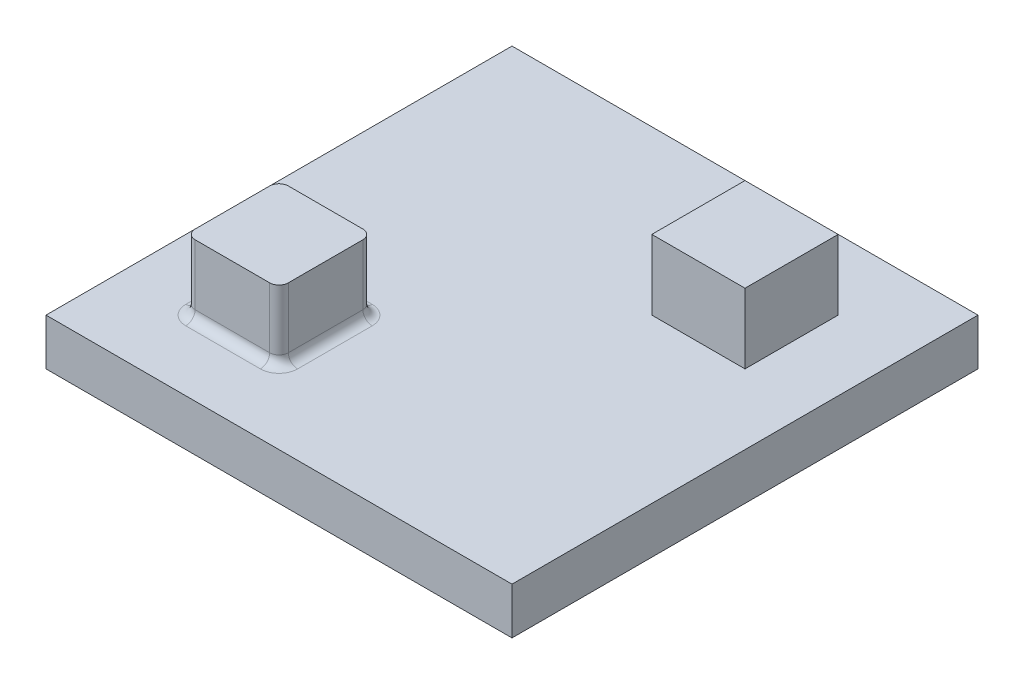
ISO-10303-21;
HEADER;
FILE_DESCRIPTION(('STEP AP214'),'2;1');
FILE_NAME('part.step','',(''),(''),'','','');
FILE_SCHEMA(('AUTOMOTIVE_DESIGN { 1 0 10303 214 1 1 1 1 }'));
ENDSEC;
DATA;
#1=APPLICATION_CONTEXT('core data for automotive mechanical design processes');
#2=APPLICATION_PROTOCOL_DEFINITION('international standard','automotive_design',2000,#1);
#3=PRODUCT_CONTEXT('',#1,'mechanical');
#4=PRODUCT('Part','Part','',(#3));
#5=PRODUCT_RELATED_PRODUCT_CATEGORY('part','',(#4));
#6=PRODUCT_DEFINITION_FORMATION('','',#4);
#7=PRODUCT_DEFINITION_CONTEXT('part definition',#1,'design');
#8=PRODUCT_DEFINITION('design','',#6,#7);
#9=PRODUCT_DEFINITION_SHAPE('','',#8);
#10=(LENGTH_UNIT() NAMED_UNIT(*) SI_UNIT(.MILLI.,.METRE.));
#11=(NAMED_UNIT(*) PLANE_ANGLE_UNIT() SI_UNIT($,.RADIAN.));
#12=(NAMED_UNIT(*) SI_UNIT($,.STERADIAN.) SOLID_ANGLE_UNIT());
#13=UNCERTAINTY_MEASURE_WITH_UNIT(LENGTH_MEASURE(1.E-05),#10,'distance_accuracy_value','');
#14=(GEOMETRIC_REPRESENTATION_CONTEXT(3) GLOBAL_UNCERTAINTY_ASSIGNED_CONTEXT((#13)) GLOBAL_UNIT_ASSIGNED_CONTEXT((#10,
#11,#12)) REPRESENTATION_CONTEXT('',''));
#15=CARTESIAN_POINT('',(0.,0.,0.));
#16=DIRECTION('',(0.,0.,1.));
#17=DIRECTION('',(1.,0.,0.));
#18=AXIS2_PLACEMENT_3D('',#15,#16,#17);
#19=CARTESIAN_POINT('',(-63.5,12.7,63.5));
#20=DIRECTION('',(0.,1.,0.));
#21=DIRECTION('',(0.,0.,1.));
#22=AXIS2_PLACEMENT_3D('',#19,#20,#21);
#23=PLANE('',#22);
#24=DIRECTION('',(0.,0.,1.));
#25=VECTOR('',#24,1.);
#26=CARTESIAN_POINT('',(-63.5,12.7,-63.5));
#27=LINE('',#26,#25);
#28=CARTESIAN_POINT('',(-63.5,12.7,-63.5));
#29=VERTEX_POINT('',#28);
#30=CARTESIAN_POINT('',(-63.5,12.7,63.5));
#31=VERTEX_POINT('',#30);
#32=EDGE_CURVE('E264',#29,#31,#27,.T.);
#33=ORIENTED_EDGE('',*,*,#32,.T.);
#34=DIRECTION('',(1.,0.,0.));
#35=VECTOR('',#34,1.);
#36=CARTESIAN_POINT('',(-63.5,12.7,63.5));
#37=LINE('',#36,#35);
#38=CARTESIAN_POINT('',(63.5,12.7,63.5));
#39=VERTEX_POINT('',#38);
#40=EDGE_CURVE('E267',#31,#39,#37,.T.);
#41=ORIENTED_EDGE('',*,*,#40,.T.);
#42=DIRECTION('',(0.,0.,-1.));
#43=VECTOR('',#42,1.);
#44=CARTESIAN_POINT('',(63.5,12.7,-63.5));
#45=LINE('',#44,#43);
#46=CARTESIAN_POINT('',(63.5,12.7,-63.5));
#47=VERTEX_POINT('',#46);
#48=EDGE_CURVE('E269',#39,#47,#45,.T.);
#49=ORIENTED_EDGE('',*,*,#48,.T.);
#50=DIRECTION('',(-1.,0.,0.));
#51=VECTOR('',#50,1.);
#52=CARTESIAN_POINT('',(-63.5,12.7,-63.5));
#53=LINE('',#52,#51);
#54=EDGE_CURVE('E271',#47,#29,#53,.T.);
#55=ORIENTED_EDGE('',*,*,#54,.T.);
#56=EDGE_LOOP('',(#33,#41,#49,#55));
#57=FACE_BOUND('',#56,.T.);
#58=CARTESIAN_POINT('',(-41.91,12.7,21.59));
#59=DIRECTION('',(0.,1.,0.));
#60=DIRECTION('',(0.,0.,1.));
#61=AXIS2_PLACEMENT_3D('',#58,#59,#60);
#62=CIRCLE('',#61,5.08);
#63=CARTESIAN_POINT('',(-41.91,12.7,16.51));
#64=VERTEX_POINT('',#63);
#65=CARTESIAN_POINT('',(-46.99,12.7,21.59));
#66=VERTEX_POINT('',#65);
#67=EDGE_CURVE('E318',#64,#66,#62,.T.);
#68=ORIENTED_EDGE('',*,*,#67,.F.);
#69=DIRECTION('',(-1.,0.,0.));
#70=VECTOR('',#69,1.);
#71=CARTESIAN_POINT('',(-63.5,12.7,16.51));
#72=LINE('',#71,#70);
#73=CARTESIAN_POINT('',(-21.59,12.7,16.51));
#74=VERTEX_POINT('',#73);
#75=EDGE_CURVE('E11',#64,#74,#72,.F.);
#76=ORIENTED_EDGE('',*,*,#75,.T.);
#77=CARTESIAN_POINT('',(-21.59,12.7,21.59));
#78=DIRECTION('',(0.,1.,0.));
#79=DIRECTION('',(0.,0.,1.));
#80=AXIS2_PLACEMENT_3D('',#77,#78,#79);
#81=CIRCLE('',#80,5.08);
#82=CARTESIAN_POINT('',(-16.51,12.7,21.59));
#83=VERTEX_POINT('',#82);
#84=EDGE_CURVE('E44',#83,#74,#81,.T.);
#85=ORIENTED_EDGE('',*,*,#84,.F.);
#86=DIRECTION('',(0.,0.,-1.));
#87=VECTOR('',#86,1.);
#88=CARTESIAN_POINT('',(-16.51,12.7,63.5));
#89=LINE('',#88,#87);
#90=CARTESIAN_POINT('',(-16.51,12.7,41.91));
#91=VERTEX_POINT('',#90);
#92=EDGE_CURVE('E331',#83,#91,#89,.F.);
#93=ORIENTED_EDGE('',*,*,#92,.T.);
#94=CARTESIAN_POINT('',(-21.59,12.7,41.91));
#95=DIRECTION('',(0.,1.,0.));
#96=DIRECTION('',(0.,0.,1.));
#97=AXIS2_PLACEMENT_3D('',#94,#95,#96);
#98=CIRCLE('',#97,5.08);
#99=CARTESIAN_POINT('',(-21.59,12.7,46.99));
#100=VERTEX_POINT('',#99);
#101=EDGE_CURVE('E328',#100,#91,#98,.T.);
#102=ORIENTED_EDGE('',*,*,#101,.F.);
#103=DIRECTION('',(1.,0.,0.));
#104=VECTOR('',#103,1.);
#105=CARTESIAN_POINT('',(-63.5,12.7,46.99));
#106=LINE('',#105,#104);
#107=CARTESIAN_POINT('',(-41.91,12.7,46.99));
#108=VERTEX_POINT('',#107);
#109=EDGE_CURVE('E326',#100,#108,#106,.F.);
#110=ORIENTED_EDGE('',*,*,#109,.T.);
#111=CARTESIAN_POINT('',(-41.91,12.7,41.91));
#112=DIRECTION('',(0.,1.,0.));
#113=DIRECTION('',(0.,0.,1.));
#114=AXIS2_PLACEMENT_3D('',#111,#112,#113);
#115=CIRCLE('',#114,5.08);
#116=CARTESIAN_POINT('',(-46.99,12.7,41.91));
#117=VERTEX_POINT('',#116);
#118=EDGE_CURVE('E323',#117,#108,#115,.T.);
#119=ORIENTED_EDGE('',*,*,#118,.F.);
#120=DIRECTION('',(0.,0.,1.));
#121=VECTOR('',#120,1.);
#122=CARTESIAN_POINT('',(-46.99,12.7,63.5));
#123=LINE('',#122,#121);
#124=EDGE_CURVE('E321',#117,#66,#123,.F.);
#125=ORIENTED_EDGE('',*,*,#124,.T.);
#126=EDGE_LOOP('',(#68,#76,#85,#93,#102,#110,#119,#125));
#127=FACE_BOUND('',#126,.T.);
#128=DIRECTION('',(0.,0.,1.));
#129=VECTOR('',#128,1.);
#130=CARTESIAN_POINT('',(19.05,12.7,-44.45));
#131=LINE('',#130,#129);
#132=CARTESIAN_POINT('',(19.05,12.7,-44.45));
#133=VERTEX_POINT('',#132);
#134=CARTESIAN_POINT('',(19.05,12.7,-19.05));
#135=VERTEX_POINT('',#134);
#136=EDGE_CURVE('E189',#133,#135,#131,.T.);
#137=ORIENTED_EDGE('',*,*,#136,.F.);
#138=DIRECTION('',(-1.,0.,0.));
#139=VECTOR('',#138,1.);
#140=CARTESIAN_POINT('',(19.05,12.7,-44.45));
#141=LINE('',#140,#139);
#142=CARTESIAN_POINT('',(44.45,12.7,-44.45));
#143=VERTEX_POINT('',#142);
#144=EDGE_CURVE('E51',#143,#133,#141,.T.);
#145=ORIENTED_EDGE('',*,*,#144,.F.);
#146=DIRECTION('',(0.,0.,-1.));
#147=VECTOR('',#146,1.);
#148=CARTESIAN_POINT('',(44.45,12.7,-44.45));
#149=LINE('',#148,#147);
#150=CARTESIAN_POINT('',(44.45,12.7,-19.05));
#151=VERTEX_POINT('',#150);
#152=EDGE_CURVE('E195',#151,#143,#149,.T.);
#153=ORIENTED_EDGE('',*,*,#152,.F.);
#154=DIRECTION('',(1.,0.,0.));
#155=VECTOR('',#154,1.);
#156=CARTESIAN_POINT('',(19.05,12.7,-19.05));
#157=LINE('',#156,#155);
#158=EDGE_CURVE('E180',#135,#151,#157,.T.);
#159=ORIENTED_EDGE('',*,*,#158,.F.);
#160=EDGE_LOOP('',(#137,#145,#153,#159));
#161=FACE_BOUND('',#160,.T.);
#162=ADVANCED_FACE('F36',(#57,#127,#161),#23,.T.);
#163=CARTESIAN_POINT('',(-63.5,12.7,-63.5));
#164=DIRECTION('',(1.,0.,0.));
#165=DIRECTION('',(0.,0.,-1.));
#166=AXIS2_PLACEMENT_3D('',#163,#164,#165);
#167=PLANE('',#166);
#168=DIRECTION('',(0.,0.,1.));
#169=VECTOR('',#168,1.);
#170=CARTESIAN_POINT('',(-63.5,0.,-63.5));
#171=LINE('',#170,#169);
#172=CARTESIAN_POINT('',(-63.5,0.,-63.5));
#173=VERTEX_POINT('',#172);
#174=CARTESIAN_POINT('',(-63.5,0.,63.5));
#175=VERTEX_POINT('',#174);
#176=EDGE_CURVE('E255',#173,#175,#171,.T.);
#177=ORIENTED_EDGE('',*,*,#176,.T.);
#178=DIRECTION('',(0.,-1.,0.));
#179=VECTOR('',#178,1.);
#180=CARTESIAN_POINT('',(-63.5,12.7,63.5));
#181=LINE('',#180,#179);
#182=EDGE_CURVE('E282',#31,#175,#181,.T.);
#183=ORIENTED_EDGE('',*,*,#182,.F.);
#184=ORIENTED_EDGE('',*,*,#32,.F.);
#185=DIRECTION('',(0.,-1.,0.));
#186=VECTOR('',#185,1.);
#187=CARTESIAN_POINT('',(-63.5,12.7,-63.5));
#188=LINE('',#187,#186);
#189=EDGE_CURVE('E273',#29,#173,#188,.T.);
#190=ORIENTED_EDGE('',*,*,#189,.T.);
#191=EDGE_LOOP('',(#177,#183,#184,#190));
#192=FACE_BOUND('',#191,.T.);
#193=ADVANCED_FACE('F38',(#192),#167,.F.);
#194=CARTESIAN_POINT('',(-63.5,12.7,63.5));
#195=DIRECTION('',(0.,0.,-1.));
#196=DIRECTION('',(-1.,0.,0.));
#197=AXIS2_PLACEMENT_3D('',#194,#195,#196);
#198=PLANE('',#197);
#199=DIRECTION('',(1.,0.,0.));
#200=VECTOR('',#199,1.);
#201=CARTESIAN_POINT('',(-63.5,0.,63.5));
#202=LINE('',#201,#200);
#203=CARTESIAN_POINT('',(63.5,0.,63.5));
#204=VERTEX_POINT('',#203);
#205=EDGE_CURVE('E258',#175,#204,#202,.T.);
#206=ORIENTED_EDGE('',*,*,#205,.T.);
#207=DIRECTION('',(0.,-1.,0.));
#208=VECTOR('',#207,1.);
#209=CARTESIAN_POINT('',(63.5,12.7,63.5));
#210=LINE('',#209,#208);
#211=EDGE_CURVE('E279',#39,#204,#210,.T.);
#212=ORIENTED_EDGE('',*,*,#211,.F.);
#213=ORIENTED_EDGE('',*,*,#40,.F.);
#214=ORIENTED_EDGE('',*,*,#182,.T.);
#215=EDGE_LOOP('',(#206,#212,#213,#214));
#216=FACE_BOUND('',#215,.T.);
#217=ADVANCED_FACE('F414',(#216),#198,.F.);
#218=CARTESIAN_POINT('',(63.5,12.7,-63.5));
#219=DIRECTION('',(-1.,0.,0.));
#220=DIRECTION('',(0.,0.,1.));
#221=AXIS2_PLACEMENT_3D('',#218,#219,#220);
#222=PLANE('',#221);
#223=DIRECTION('',(0.,0.,-1.));
#224=VECTOR('',#223,1.);
#225=CARTESIAN_POINT('',(63.5,0.,-63.5));
#226=LINE('',#225,#224);
#227=CARTESIAN_POINT('',(63.5,0.,-63.5));
#228=VERTEX_POINT('',#227);
#229=EDGE_CURVE('E260',#204,#228,#226,.T.);
#230=ORIENTED_EDGE('',*,*,#229,.T.);
#231=DIRECTION('',(0.,-1.,0.));
#232=VECTOR('',#231,1.);
#233=CARTESIAN_POINT('',(63.5,12.7,-63.5));
#234=LINE('',#233,#232);
#235=EDGE_CURVE('E276',#47,#228,#234,.T.);
#236=ORIENTED_EDGE('',*,*,#235,.F.);
#237=ORIENTED_EDGE('',*,*,#48,.F.);
#238=ORIENTED_EDGE('',*,*,#211,.T.);
#239=EDGE_LOOP('',(#230,#236,#237,#238));
#240=FACE_BOUND('',#239,.T.);
#241=ADVANCED_FACE('F423',(#240),#222,.F.);
#242=CARTESIAN_POINT('',(-63.5,12.7,-63.5));
#243=DIRECTION('',(0.,0.,1.));
#244=DIRECTION('',(1.,0.,0.));
#245=AXIS2_PLACEMENT_3D('',#242,#243,#244);
#246=PLANE('',#245);
#247=DIRECTION('',(-1.,0.,0.));
#248=VECTOR('',#247,1.);
#249=CARTESIAN_POINT('',(-63.5,0.,-63.5));
#250=LINE('',#249,#248);
#251=EDGE_CURVE('E262',#228,#173,#250,.T.);
#252=ORIENTED_EDGE('',*,*,#251,.T.);
#253=ORIENTED_EDGE('',*,*,#189,.F.);
#254=ORIENTED_EDGE('',*,*,#54,.F.);
#255=ORIENTED_EDGE('',*,*,#235,.T.);
#256=EDGE_LOOP('',(#252,#253,#254,#255));
#257=FACE_BOUND('',#256,.T.);
#258=ADVANCED_FACE('F420',(#257),#246,.F.);
#259=CARTESIAN_POINT('',(-63.5,0.,63.5));
#260=DIRECTION('',(0.,1.,0.));
#261=DIRECTION('',(0.,0.,1.));
#262=AXIS2_PLACEMENT_3D('',#259,#260,#261);
#263=PLANE('',#262);
#264=ORIENTED_EDGE('',*,*,#176,.F.);
#265=ORIENTED_EDGE('',*,*,#251,.F.);
#266=ORIENTED_EDGE('',*,*,#229,.F.);
#267=ORIENTED_EDGE('',*,*,#205,.F.);
#268=EDGE_LOOP('',(#264,#265,#266,#267));
#269=FACE_BOUND('',#268,.T.);
#270=ADVANCED_FACE('F418',(#269),#263,.F.);
#271=CARTESIAN_POINT('',(-19.05,31.75,19.05));
#272=DIRECTION('',(-1.,0.,0.));
#273=DIRECTION('',(0.,0.,1.));
#274=AXIS2_PLACEMENT_3D('',#271,#272,#273);
#275=PLANE('',#274);
#276=DIRECTION('',(0.,0.,-1.));
#277=VECTOR('',#276,1.);
#278=CARTESIAN_POINT('',(-19.05,31.75,19.05));
#279=LINE('',#278,#277);
#280=CARTESIAN_POINT('',(-19.05,31.75,41.91));
#281=VERTEX_POINT('',#280);
#282=CARTESIAN_POINT('',(-19.05,31.75,21.59));
#283=VERTEX_POINT('',#282);
#284=EDGE_CURVE('E243',#281,#283,#279,.T.);
#285=ORIENTED_EDGE('',*,*,#284,.F.);
#286=DIRECTION('',(0.,-1.,0.));
#287=VECTOR('',#286,1.);
#288=CARTESIAN_POINT('',(-19.05,31.75,41.91));
#289=LINE('',#288,#287);
#290=CARTESIAN_POINT('',(-19.05,15.24,41.91));
#291=VERTEX_POINT('',#290);
#292=EDGE_CURVE('E289',#281,#291,#289,.T.);
#293=ORIENTED_EDGE('',*,*,#292,.T.);
#294=DIRECTION('',(0.,0.,-1.));
#295=VECTOR('',#294,1.);
#296=CARTESIAN_POINT('',(-19.05,15.24,19.05));
#297=LINE('',#296,#295);
#298=CARTESIAN_POINT('',(-19.05,15.24,21.59));
#299=VERTEX_POINT('',#298);
#300=EDGE_CURVE('E285',#291,#299,#297,.T.);
#301=ORIENTED_EDGE('',*,*,#300,.T.);
#302=DIRECTION('',(0.,-1.,0.));
#303=VECTOR('',#302,1.);
#304=CARTESIAN_POINT('',(-19.05,31.75,21.59));
#305=LINE('',#304,#303);
#306=EDGE_CURVE('E287',#299,#283,#305,.F.);
#307=ORIENTED_EDGE('',*,*,#306,.T.);
#308=EDGE_LOOP('',(#285,#293,#301,#307));
#309=FACE_BOUND('',#308,.T.);
#310=ADVANCED_FACE('F389',(#309),#275,.F.);
#311=CARTESIAN_POINT('',(-19.05,31.75,19.05));
#312=DIRECTION('',(0.,0.,1.));
#313=DIRECTION('',(1.,0.,0.));
#314=AXIS2_PLACEMENT_3D('',#311,#312,#313);
#315=PLANE('',#314);
#316=DIRECTION('',(-1.,0.,0.));
#317=VECTOR('',#316,1.);
#318=CARTESIAN_POINT('',(-19.05,15.24,19.05));
#319=LINE('',#318,#317);
#320=CARTESIAN_POINT('',(-21.59,15.24,19.05));
#321=VERTEX_POINT('',#320);
#322=CARTESIAN_POINT('',(-41.91,15.24,19.05));
#323=VERTEX_POINT('',#322);
#324=EDGE_CURVE('E312',#321,#323,#319,.T.);
#325=ORIENTED_EDGE('',*,*,#324,.T.);
#326=DIRECTION('',(0.,-1.,0.));
#327=VECTOR('',#326,1.);
#328=CARTESIAN_POINT('',(-41.91,31.75,19.05));
#329=LINE('',#328,#327);
#330=CARTESIAN_POINT('',(-41.91,31.75,19.05));
#331=VERTEX_POINT('',#330);
#332=EDGE_CURVE('E316',#323,#331,#329,.F.);
#333=ORIENTED_EDGE('',*,*,#332,.T.);
#334=DIRECTION('',(-1.,0.,0.));
#335=VECTOR('',#334,1.);
#336=CARTESIAN_POINT('',(-19.05,31.75,19.05));
#337=LINE('',#336,#335);
#338=CARTESIAN_POINT('',(-21.59,31.75,19.05));
#339=VERTEX_POINT('',#338);
#340=EDGE_CURVE('E246',#339,#331,#337,.T.);
#341=ORIENTED_EDGE('',*,*,#340,.F.);
#342=DIRECTION('',(0.,-1.,0.));
#343=VECTOR('',#342,1.);
#344=CARTESIAN_POINT('',(-21.59,31.75,19.05));
#345=LINE('',#344,#343);
#346=EDGE_CURVE('E314',#339,#321,#345,.T.);
#347=ORIENTED_EDGE('',*,*,#346,.T.);
#348=EDGE_LOOP('',(#325,#333,#341,#347));
#349=FACE_BOUND('',#348,.T.);
#350=ADVANCED_FACE('F393',(#349),#315,.F.);
#351=CARTESIAN_POINT('',(-44.45,31.75,19.05));
#352=DIRECTION('',(1.,0.,0.));
#353=DIRECTION('',(0.,0.,-1.));
#354=AXIS2_PLACEMENT_3D('',#351,#352,#353);
#355=PLANE('',#354);
#356=DIRECTION('',(0.,0.,1.));
#357=VECTOR('',#356,1.);
#358=CARTESIAN_POINT('',(-44.45,15.24,19.05));
#359=LINE('',#358,#357);
#360=CARTESIAN_POINT('',(-44.45,15.24,21.59));
#361=VERTEX_POINT('',#360);
#362=CARTESIAN_POINT('',(-44.45,15.24,41.91));
#363=VERTEX_POINT('',#362);
#364=EDGE_CURVE('E306',#361,#363,#359,.T.);
#365=ORIENTED_EDGE('',*,*,#364,.T.);
#366=DIRECTION('',(0.,-1.,0.));
#367=VECTOR('',#366,1.);
#368=CARTESIAN_POINT('',(-44.45,31.75,41.91));
#369=LINE('',#368,#367);
#370=CARTESIAN_POINT('',(-44.45,31.75,41.91));
#371=VERTEX_POINT('',#370);
#372=EDGE_CURVE('E310',#363,#371,#369,.F.);
#373=ORIENTED_EDGE('',*,*,#372,.T.);
#374=DIRECTION('',(0.,0.,1.));
#375=VECTOR('',#374,1.);
#376=CARTESIAN_POINT('',(-44.45,31.75,19.05));
#377=LINE('',#376,#375);
#378=CARTESIAN_POINT('',(-44.45,31.75,21.59));
#379=VERTEX_POINT('',#378);
#380=EDGE_CURVE('E249',#379,#371,#377,.T.);
#381=ORIENTED_EDGE('',*,*,#380,.F.);
#382=DIRECTION('',(0.,-1.,0.));
#383=VECTOR('',#382,1.);
#384=CARTESIAN_POINT('',(-44.45,31.75,21.59));
#385=LINE('',#384,#383);
#386=EDGE_CURVE('E308',#379,#361,#385,.T.);
#387=ORIENTED_EDGE('',*,*,#386,.T.);
#388=EDGE_LOOP('',(#365,#373,#381,#387));
#389=FACE_BOUND('',#388,.T.);
#390=ADVANCED_FACE('F399',(#389),#355,.F.);
#391=CARTESIAN_POINT('',(-19.05,31.75,44.45));
#392=DIRECTION('',(0.,0.,-1.));
#393=DIRECTION('',(-1.,0.,0.));
#394=AXIS2_PLACEMENT_3D('',#391,#392,#393);
#395=PLANE('',#394);
#396=DIRECTION('',(1.,0.,0.));
#397=VECTOR('',#396,1.);
#398=CARTESIAN_POINT('',(-19.05,15.24,44.45));
#399=LINE('',#398,#397);
#400=CARTESIAN_POINT('',(-41.91,15.24,44.45));
#401=VERTEX_POINT('',#400);
#402=CARTESIAN_POINT('',(-21.59,15.24,44.45));
#403=VERTEX_POINT('',#402);
#404=EDGE_CURVE('E292',#401,#403,#399,.T.);
#405=ORIENTED_EDGE('',*,*,#404,.T.);
#406=DIRECTION('',(0.,-1.,0.));
#407=VECTOR('',#406,1.);
#408=CARTESIAN_POINT('',(-21.59,31.75,44.45));
#409=LINE('',#408,#407);
#410=CARTESIAN_POINT('',(-21.59,31.75,44.45));
#411=VERTEX_POINT('',#410);
#412=EDGE_CURVE('E296',#403,#411,#409,.F.);
#413=ORIENTED_EDGE('',*,*,#412,.T.);
#414=DIRECTION('',(1.,0.,0.));
#415=VECTOR('',#414,1.);
#416=CARTESIAN_POINT('',(-19.05,31.75,44.45));
#417=LINE('',#416,#415);
#418=CARTESIAN_POINT('',(-41.91,31.75,44.45));
#419=VERTEX_POINT('',#418);
#420=EDGE_CURVE('E252',#419,#411,#417,.T.);
#421=ORIENTED_EDGE('',*,*,#420,.F.);
#422=DIRECTION('',(0.,-1.,0.));
#423=VECTOR('',#422,1.);
#424=CARTESIAN_POINT('',(-41.91,31.75,44.45));
#425=LINE('',#424,#423);
#426=EDGE_CURVE('E294',#419,#401,#425,.T.);
#427=ORIENTED_EDGE('',*,*,#426,.T.);
#428=EDGE_LOOP('',(#405,#413,#421,#427));
#429=FACE_BOUND('',#428,.T.);
#430=ADVANCED_FACE('F353',(#429),#395,.F.);
#431=CARTESIAN_POINT('',(-19.05,31.75,44.45));
#432=DIRECTION('',(0.,-1.,0.));
#433=DIRECTION('',(0.,0.,-1.));
#434=AXIS2_PLACEMENT_3D('',#431,#432,#433);
#435=PLANE('',#434);
#436=ORIENTED_EDGE('',*,*,#420,.T.);
#437=CARTESIAN_POINT('',(-21.59,31.75,41.91));
#438=DIRECTION('',(0.,-1.,0.));
#439=DIRECTION('',(0.,0.,-1.));
#440=AXIS2_PLACEMENT_3D('',#437,#438,#439);
#441=CIRCLE('',#440,2.54);
#442=EDGE_CURVE('E304',#411,#281,#441,.F.);
#443=ORIENTED_EDGE('',*,*,#442,.T.);
#444=ORIENTED_EDGE('',*,*,#284,.T.);
#445=CARTESIAN_POINT('',(-21.59,31.75,21.59));
#446=DIRECTION('',(0.,-1.,0.));
#447=DIRECTION('',(0.,0.,-1.));
#448=AXIS2_PLACEMENT_3D('',#445,#446,#447);
#449=CIRCLE('',#448,2.54);
#450=EDGE_CURVE('E298',#283,#339,#449,.F.);
#451=ORIENTED_EDGE('',*,*,#450,.T.);
#452=ORIENTED_EDGE('',*,*,#340,.T.);
#453=CARTESIAN_POINT('',(-41.91,31.75,21.59));
#454=DIRECTION('',(0.,-1.,0.));
#455=DIRECTION('',(0.,0.,-1.));
#456=AXIS2_PLACEMENT_3D('',#453,#454,#455);
#457=CIRCLE('',#456,2.54);
#458=EDGE_CURVE('E300',#331,#379,#457,.F.);
#459=ORIENTED_EDGE('',*,*,#458,.T.);
#460=ORIENTED_EDGE('',*,*,#380,.T.);
#461=CARTESIAN_POINT('',(-41.91,31.75,41.91));
#462=DIRECTION('',(0.,-1.,0.));
#463=DIRECTION('',(0.,0.,-1.));
#464=AXIS2_PLACEMENT_3D('',#461,#462,#463);
#465=CIRCLE('',#464,2.54);
#466=EDGE_CURVE('E302',#371,#419,#465,.F.);
#467=ORIENTED_EDGE('',*,*,#466,.T.);
#468=EDGE_LOOP('',(#436,#443,#444,#451,#452,#459,#460,#467));
#469=FACE_BOUND('',#468,.T.);
#470=ADVANCED_FACE('F356',(#469),#435,.F.);
#471=CARTESIAN_POINT('',(-41.91,31.75,21.59));
#472=DIRECTION('',(0.,-1.,0.));
#473=DIRECTION('',(0.,0.,-1.));
#474=AXIS2_PLACEMENT_3D('',#471,#472,#473);
#475=CYLINDRICAL_SURFACE('',#474,2.54);
#476=CARTESIAN_POINT('',(-41.91,15.24,21.59));
#477=DIRECTION('',(0.,1.,0.));
#478=DIRECTION('',(0.,0.,1.));
#479=AXIS2_PLACEMENT_3D('',#476,#477,#478);
#480=CIRCLE('',#479,2.54);
#481=EDGE_CURVE('E240',#361,#323,#480,.F.);
#482=ORIENTED_EDGE('',*,*,#481,.F.);
#483=ORIENTED_EDGE('',*,*,#386,.F.);
#484=ORIENTED_EDGE('',*,*,#458,.F.);
#485=ORIENTED_EDGE('',*,*,#332,.F.);
#486=EDGE_LOOP('',(#482,#483,#484,#485));
#487=FACE_BOUND('',#486,.T.);
#488=ADVANCED_FACE('F396',(#487),#475,.T.);
#489=CARTESIAN_POINT('',(-41.91,15.24,21.59));
#490=DIRECTION('',(0.,1.,0.));
#491=DIRECTION('',(0.,0.,1.));
#492=AXIS2_PLACEMENT_3D('',#489,#490,#491);
#493=TOROIDAL_SURFACE('',#492,5.08,2.54);
#494=CARTESIAN_POINT('',(-46.99,15.24,21.59));
#495=DIRECTION('',(0.,0.,1.));
#496=DIRECTION('',(1.,0.,0.));
#497=AXIS2_PLACEMENT_3D('',#494,#495,#496);
#498=CIRCLE('',#497,2.54);
#499=EDGE_CURVE('E234',#361,#66,#498,.F.);
#500=ORIENTED_EDGE('',*,*,#499,.F.);
#501=ORIENTED_EDGE('',*,*,#481,.T.);
#502=CARTESIAN_POINT('',(-41.91,15.24,16.51));
#503=DIRECTION('',(1.,0.,0.));
#504=DIRECTION('',(0.,0.,-1.));
#505=AXIS2_PLACEMENT_3D('',#502,#503,#504);
#506=CIRCLE('',#505,2.54);
#507=EDGE_CURVE('E237',#64,#323,#506,.F.);
#508=ORIENTED_EDGE('',*,*,#507,.F.);
#509=ORIENTED_EDGE('',*,*,#67,.T.);
#510=EDGE_LOOP('',(#500,#501,#508,#509));
#511=FACE_BOUND('',#510,.T.);
#512=ADVANCED_FACE('F374',(#511),#493,.F.);
#513=CARTESIAN_POINT('',(-21.59,31.75,21.59));
#514=DIRECTION('',(0.,-1.,0.));
#515=DIRECTION('',(0.,0.,-1.));
#516=AXIS2_PLACEMENT_3D('',#513,#514,#515);
#517=CYLINDRICAL_SURFACE('',#516,2.54);
#518=ORIENTED_EDGE('',*,*,#450,.F.);
#519=ORIENTED_EDGE('',*,*,#306,.F.);
#520=CARTESIAN_POINT('',(-21.59,15.24,21.59));
#521=DIRECTION('',(0.,1.,0.));
#522=DIRECTION('',(0.,0.,1.));
#523=AXIS2_PLACEMENT_3D('',#520,#521,#522);
#524=CIRCLE('',#523,2.54);
#525=EDGE_CURVE('E231',#321,#299,#524,.F.);
#526=ORIENTED_EDGE('',*,*,#525,.F.);
#527=ORIENTED_EDGE('',*,*,#346,.F.);
#528=EDGE_LOOP('',(#518,#519,#526,#527));
#529=FACE_BOUND('',#528,.T.);
#530=ADVANCED_FACE('F387',(#529),#517,.T.);
#531=CARTESIAN_POINT('',(-19.05,15.24,16.51));
#532=DIRECTION('',(-1.,0.,0.));
#533=DIRECTION('',(0.,0.,1.));
#534=AXIS2_PLACEMENT_3D('',#531,#532,#533);
#535=CYLINDRICAL_SURFACE('',#534,2.54);
#536=ORIENTED_EDGE('',*,*,#507,.T.);
#537=ORIENTED_EDGE('',*,*,#324,.F.);
#538=CARTESIAN_POINT('',(-21.59,15.24,16.51));
#539=DIRECTION('',(-1.,0.,0.));
#540=DIRECTION('',(0.,0.,1.));
#541=AXIS2_PLACEMENT_3D('',#538,#539,#540);
#542=CIRCLE('',#541,2.54);
#543=EDGE_CURVE('E229',#74,#321,#542,.T.);
#544=ORIENTED_EDGE('',*,*,#543,.F.);
#545=ORIENTED_EDGE('',*,*,#75,.F.);
#546=EDGE_LOOP('',(#536,#537,#544,#545));
#547=FACE_BOUND('',#546,.T.);
#548=ADVANCED_FACE('F379',(#547),#535,.F.);
#549=CARTESIAN_POINT('',(-46.99,15.24,19.05));
#550=DIRECTION('',(0.,0.,1.));
#551=DIRECTION('',(1.,0.,0.));
#552=AXIS2_PLACEMENT_3D('',#549,#550,#551);
#553=CYLINDRICAL_SURFACE('',#552,2.54);
#554=ORIENTED_EDGE('',*,*,#499,.T.);
#555=ORIENTED_EDGE('',*,*,#124,.F.);
#556=CARTESIAN_POINT('',(-46.99,15.24,41.91));
#557=DIRECTION('',(0.,0.,-1.));
#558=DIRECTION('',(-1.,0.,0.));
#559=AXIS2_PLACEMENT_3D('',#556,#557,#558);
#560=CIRCLE('',#559,2.54);
#561=EDGE_CURVE('E226',#363,#117,#560,.T.);
#562=ORIENTED_EDGE('',*,*,#561,.F.);
#563=ORIENTED_EDGE('',*,*,#364,.F.);
#564=EDGE_LOOP('',(#554,#555,#562,#563));
#565=FACE_BOUND('',#564,.T.);
#566=ADVANCED_FACE('F370',(#565),#553,.F.);
#567=CARTESIAN_POINT('',(-41.91,31.75,41.91));
#568=DIRECTION('',(0.,-1.,0.));
#569=DIRECTION('',(0.,0.,-1.));
#570=AXIS2_PLACEMENT_3D('',#567,#568,#569);
#571=CYLINDRICAL_SURFACE('',#570,2.54);
#572=ORIENTED_EDGE('',*,*,#466,.F.);
#573=ORIENTED_EDGE('',*,*,#372,.F.);
#574=CARTESIAN_POINT('',(-41.91,15.24,41.91));
#575=DIRECTION('',(0.,1.,0.));
#576=DIRECTION('',(0.,0.,1.));
#577=AXIS2_PLACEMENT_3D('',#574,#575,#576);
#578=CIRCLE('',#577,2.54);
#579=EDGE_CURVE('E223',#401,#363,#578,.F.);
#580=ORIENTED_EDGE('',*,*,#579,.F.);
#581=ORIENTED_EDGE('',*,*,#426,.F.);
#582=EDGE_LOOP('',(#572,#573,#580,#581));
#583=FACE_BOUND('',#582,.T.);
#584=ADVANCED_FACE('F362',(#583),#571,.T.);
#585=CARTESIAN_POINT('',(-21.59,15.24,21.59));
#586=DIRECTION('',(0.,1.,0.));
#587=DIRECTION('',(0.,0.,1.));
#588=AXIS2_PLACEMENT_3D('',#585,#586,#587);
#589=TOROIDAL_SURFACE('',#588,5.08,2.54);
#590=ORIENTED_EDGE('',*,*,#543,.T.);
#591=ORIENTED_EDGE('',*,*,#525,.T.);
#592=CARTESIAN_POINT('',(-16.51,15.24,21.59));
#593=DIRECTION('',(0.,0.,1.));
#594=DIRECTION('',(1.,0.,0.));
#595=AXIS2_PLACEMENT_3D('',#592,#593,#594);
#596=CIRCLE('',#595,2.54);
#597=EDGE_CURVE('E220',#83,#299,#596,.F.);
#598=ORIENTED_EDGE('',*,*,#597,.F.);
#599=ORIENTED_EDGE('',*,*,#84,.T.);
#600=EDGE_LOOP('',(#590,#591,#598,#599));
#601=FACE_BOUND('',#600,.T.);
#602=ADVANCED_FACE('F382',(#601),#589,.F.);
#603=CARTESIAN_POINT('',(-41.91,15.24,41.91));
#604=DIRECTION('',(0.,1.,0.));
#605=DIRECTION('',(0.,0.,1.));
#606=AXIS2_PLACEMENT_3D('',#603,#604,#605);
#607=TOROIDAL_SURFACE('',#606,5.08,2.54);
#608=ORIENTED_EDGE('',*,*,#561,.T.);
#609=ORIENTED_EDGE('',*,*,#118,.T.);
#610=CARTESIAN_POINT('',(-41.91,15.24,46.99));
#611=DIRECTION('',(1.,0.,0.));
#612=DIRECTION('',(0.,0.,-1.));
#613=AXIS2_PLACEMENT_3D('',#610,#611,#612);
#614=CIRCLE('',#613,2.54);
#615=EDGE_CURVE('E217',#401,#108,#614,.F.);
#616=ORIENTED_EDGE('',*,*,#615,.F.);
#617=ORIENTED_EDGE('',*,*,#579,.T.);
#618=EDGE_LOOP('',(#608,#609,#616,#617));
#619=FACE_BOUND('',#618,.T.);
#620=ADVANCED_FACE('F367',(#619),#607,.F.);
#621=CARTESIAN_POINT('',(-16.51,15.24,19.05));
#622=DIRECTION('',(0.,0.,-1.));
#623=DIRECTION('',(-1.,0.,0.));
#624=AXIS2_PLACEMENT_3D('',#621,#622,#623);
#625=CYLINDRICAL_SURFACE('',#624,2.54);
#626=ORIENTED_EDGE('',*,*,#597,.T.);
#627=ORIENTED_EDGE('',*,*,#300,.F.);
#628=CARTESIAN_POINT('',(-16.51,15.24,41.91));
#629=DIRECTION('',(0.,0.,-1.));
#630=DIRECTION('',(-1.,0.,0.));
#631=AXIS2_PLACEMENT_3D('',#628,#629,#630);
#632=CIRCLE('',#631,2.54);
#633=EDGE_CURVE('E214',#91,#291,#632,.T.);
#634=ORIENTED_EDGE('',*,*,#633,.F.);
#635=ORIENTED_EDGE('',*,*,#92,.F.);
#636=EDGE_LOOP('',(#626,#627,#634,#635));
#637=FACE_BOUND('',#636,.T.);
#638=ADVANCED_FACE('F338',(#637),#625,.F.);
#639=CARTESIAN_POINT('',(-19.05,15.24,46.99));
#640=DIRECTION('',(1.,0.,0.));
#641=DIRECTION('',(0.,0.,-1.));
#642=AXIS2_PLACEMENT_3D('',#639,#640,#641);
#643=CYLINDRICAL_SURFACE('',#642,2.54);
#644=ORIENTED_EDGE('',*,*,#615,.T.);
#645=ORIENTED_EDGE('',*,*,#109,.F.);
#646=CARTESIAN_POINT('',(-21.59,15.24,46.99));
#647=DIRECTION('',(-1.,0.,0.));
#648=DIRECTION('',(0.,0.,1.));
#649=AXIS2_PLACEMENT_3D('',#646,#647,#648);
#650=CIRCLE('',#649,2.54);
#651=EDGE_CURVE('E210',#403,#100,#650,.T.);
#652=ORIENTED_EDGE('',*,*,#651,.F.);
#653=ORIENTED_EDGE('',*,*,#404,.F.);
#654=EDGE_LOOP('',(#644,#645,#652,#653));
#655=FACE_BOUND('',#654,.T.);
#656=ADVANCED_FACE('F346',(#655),#643,.F.);
#657=CARTESIAN_POINT('',(-21.59,15.24,41.91));
#658=DIRECTION('',(0.,1.,0.));
#659=DIRECTION('',(0.,0.,1.));
#660=AXIS2_PLACEMENT_3D('',#657,#658,#659);
#661=TOROIDAL_SURFACE('',#660,5.08,2.54);
#662=ORIENTED_EDGE('',*,*,#101,.T.);
#663=ORIENTED_EDGE('',*,*,#633,.T.);
#664=CARTESIAN_POINT('',(-21.59,15.24,41.91));
#665=DIRECTION('',(0.,1.,0.));
#666=DIRECTION('',(0.,0.,1.));
#667=AXIS2_PLACEMENT_3D('',#664,#665,#666);
#668=CIRCLE('',#667,2.54);
#669=EDGE_CURVE('E208',#403,#291,#668,.T.);
#670=ORIENTED_EDGE('',*,*,#669,.F.);
#671=ORIENTED_EDGE('',*,*,#651,.T.);
#672=EDGE_LOOP('',(#662,#663,#670,#671));
#673=FACE_BOUND('',#672,.T.);
#674=ADVANCED_FACE('F341',(#673),#661,.F.);
#675=CARTESIAN_POINT('',(-21.59,31.75,41.91));
#676=DIRECTION('',(0.,-1.,0.));
#677=DIRECTION('',(0.,0.,-1.));
#678=AXIS2_PLACEMENT_3D('',#675,#676,#677);
#679=CYLINDRICAL_SURFACE('',#678,2.54);
#680=ORIENTED_EDGE('',*,*,#442,.F.);
#681=ORIENTED_EDGE('',*,*,#412,.F.);
#682=ORIENTED_EDGE('',*,*,#669,.T.);
#683=ORIENTED_EDGE('',*,*,#292,.F.);
#684=EDGE_LOOP('',(#680,#681,#682,#683));
#685=FACE_BOUND('',#684,.T.);
#686=ADVANCED_FACE('F349',(#685),#679,.T.);
#687=CARTESIAN_POINT('',(19.05,67.6710244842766,-44.45));
#688=DIRECTION('',(0.,0.,1.));
#689=DIRECTION('',(1.,0.,0.));
#690=AXIS2_PLACEMENT_3D('',#687,#688,#689);
#691=PLANE('',#690);
#692=DIRECTION('',(0.,-1.,0.));
#693=VECTOR('',#692,1.);
#694=CARTESIAN_POINT('',(19.05,67.6710244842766,-44.45));
#695=LINE('',#694,#693);
#696=CARTESIAN_POINT('',(19.05,31.75,-44.45));
#697=VERTEX_POINT('',#696);
#698=EDGE_CURVE('E191',#697,#133,#695,.T.);
#699=ORIENTED_EDGE('',*,*,#698,.F.);
#700=DIRECTION('',(1.,0.,0.));
#701=VECTOR('',#700,1.);
#702=CARTESIAN_POINT('',(19.05,31.75,-44.45));
#703=LINE('',#702,#701);
#704=CARTESIAN_POINT('',(44.45,31.75,-44.45));
#705=VERTEX_POINT('',#704);
#706=EDGE_CURVE('E185',#697,#705,#703,.T.);
#707=ORIENTED_EDGE('',*,*,#706,.T.);
#708=DIRECTION('',(0.,-1.,0.));
#709=VECTOR('',#708,1.);
#710=CARTESIAN_POINT('',(44.45,67.6710244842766,-44.45));
#711=LINE('',#710,#709);
#712=EDGE_CURVE('E202',#705,#143,#711,.T.);
#713=ORIENTED_EDGE('',*,*,#712,.T.);
#714=ORIENTED_EDGE('',*,*,#144,.T.);
#715=EDGE_LOOP('',(#699,#707,#713,#714));
#716=FACE_BOUND('',#715,.T.);
#717=ADVANCED_FACE('F566',(#716),#691,.F.);
#718=CARTESIAN_POINT('',(44.45,67.6710244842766,-44.45));
#719=DIRECTION('',(-1.,0.,0.));
#720=DIRECTION('',(0.,0.,1.));
#721=AXIS2_PLACEMENT_3D('',#718,#719,#720);
#722=PLANE('',#721);
#723=ORIENTED_EDGE('',*,*,#712,.F.);
#724=DIRECTION('',(0.,0.,1.));
#725=VECTOR('',#724,1.);
#726=CARTESIAN_POINT('',(44.45,31.75,-44.45));
#727=LINE('',#726,#725);
#728=CARTESIAN_POINT('',(44.45,31.75,-19.05));
#729=VERTEX_POINT('',#728);
#730=EDGE_CURVE('E207',#705,#729,#727,.T.);
#731=ORIENTED_EDGE('',*,*,#730,.T.);
#732=DIRECTION('',(0.,-1.,0.));
#733=VECTOR('',#732,1.);
#734=CARTESIAN_POINT('',(44.45,67.6710244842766,-19.05));
#735=LINE('',#734,#733);
#736=EDGE_CURVE('E186',#729,#151,#735,.T.);
#737=ORIENTED_EDGE('',*,*,#736,.T.);
#738=ORIENTED_EDGE('',*,*,#152,.T.);
#739=EDGE_LOOP('',(#723,#731,#737,#738));
#740=FACE_BOUND('',#739,.T.);
#741=ADVANCED_FACE('F580',(#740),#722,.F.);
#742=CARTESIAN_POINT('',(19.05,67.6710244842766,-19.05));
#743=DIRECTION('',(0.,0.,-1.));
#744=DIRECTION('',(-1.,0.,0.));
#745=AXIS2_PLACEMENT_3D('',#742,#743,#744);
#746=PLANE('',#745);
#747=ORIENTED_EDGE('',*,*,#736,.F.);
#748=DIRECTION('',(-1.,0.,0.));
#749=VECTOR('',#748,1.);
#750=CARTESIAN_POINT('',(19.05,31.75,-19.05));
#751=LINE('',#750,#749);
#752=CARTESIAN_POINT('',(19.05,31.75,-19.05));
#753=VERTEX_POINT('',#752);
#754=EDGE_CURVE('E182',#729,#753,#751,.T.);
#755=ORIENTED_EDGE('',*,*,#754,.T.);
#756=DIRECTION('',(0.,-1.,0.));
#757=VECTOR('',#756,1.);
#758=CARTESIAN_POINT('',(19.05,67.6710244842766,-19.05));
#759=LINE('',#758,#757);
#760=EDGE_CURVE('E175',#753,#135,#759,.T.);
#761=ORIENTED_EDGE('',*,*,#760,.T.);
#762=ORIENTED_EDGE('',*,*,#158,.T.);
#763=EDGE_LOOP('',(#747,#755,#761,#762));
#764=FACE_BOUND('',#763,.T.);
#765=ADVANCED_FACE('F178',(#764),#746,.F.);
#766=CARTESIAN_POINT('',(19.05,67.6710244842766,-44.45));
#767=DIRECTION('',(1.,0.,0.));
#768=DIRECTION('',(0.,0.,-1.));
#769=AXIS2_PLACEMENT_3D('',#766,#767,#768);
#770=PLANE('',#769);
#771=ORIENTED_EDGE('',*,*,#760,.F.);
#772=DIRECTION('',(0.,0.,-1.));
#773=VECTOR('',#772,1.);
#774=CARTESIAN_POINT('',(19.05,31.75,-44.45));
#775=LINE('',#774,#773);
#776=EDGE_CURVE('E211',#753,#697,#775,.T.);
#777=ORIENTED_EDGE('',*,*,#776,.T.);
#778=ORIENTED_EDGE('',*,*,#698,.T.);
#779=ORIENTED_EDGE('',*,*,#136,.T.);
#780=EDGE_LOOP('',(#771,#777,#778,#779));
#781=FACE_BOUND('',#780,.T.);
#782=ADVANCED_FACE('F190',(#781),#770,.F.);
#783=CARTESIAN_POINT('',(-19.05,31.75,44.45));
#784=DIRECTION('',(0.,-1.,0.));
#785=DIRECTION('',(0.,0.,-1.));
#786=AXIS2_PLACEMENT_3D('',#783,#784,#785);
#787=PLANE('',#786);
#788=ORIENTED_EDGE('',*,*,#754,.F.);
#789=ORIENTED_EDGE('',*,*,#730,.F.);
#790=ORIENTED_EDGE('',*,*,#706,.F.);
#791=ORIENTED_EDGE('',*,*,#776,.F.);
#792=EDGE_LOOP('',(#788,#789,#790,#791));
#793=FACE_BOUND('',#792,.T.);
#794=ADVANCED_FACE('F606',(#793),#787,.F.);
#795=CLOSED_SHELL('',(#162,#193,#217,#241,#258,#270,#310,#350,#390,#430,#470,#488,#512,#530,
#548,#566,#584,#602,#620,#638,#656,#674,#686,#717,#741,#765,#782,#794));
#796=MANIFOLD_SOLID_BREP('B2',#795);
#797=ADVANCED_BREP_SHAPE_REPRESENTATION('',(#18,#796),#14);
#798=SHAPE_DEFINITION_REPRESENTATION(#9,#797);
ENDSEC;
END-ISO-10303-21;
